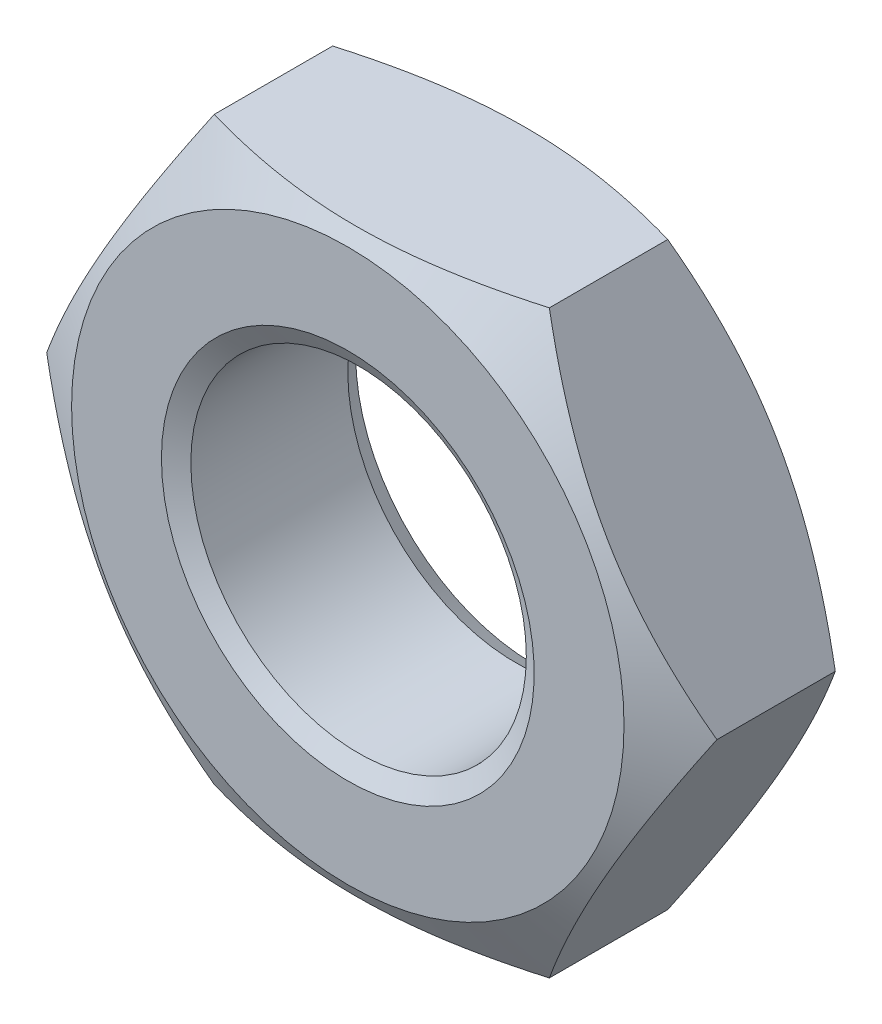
from build123d import *
from OCP.BRepFilletAPI import BRepFilletAPI_MakeChamfer

# Parameters (mm, degrees)
SKETCH1_R        = 4.5
BASENUT_DEPTH    = 5
ENDCHAMFER_SIZE  = 0.5
ENDCHAMFER_SIZE2 = 0.288675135


with BuildPart() as part:
    # Sketch1 → BaseNut (new body)
    with BuildSketch(Plane.XY):
        Polygon((4.494671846, -7.785), (8.989343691, 0), (4.494671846, 7.785), (-4.494671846, 7.785), (-8.989343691, 0), (-4.494671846, -7.785), align=None)
        Circle(SKETCH1_R, mode=Mode.SUBTRACT)
    extrude(amount=-BASENUT_DEPTH)

    # Sketch2 → Double-Chamfer (revolve, cut)
    with BuildSketch(Plane(origin=(0, 0, 0), x_dir=(1, 0, 0), z_dir=(0, 1, 0))):
        Polygon((-8.989343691, 5), (-7.41, 5), (-8.989343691, 4.088165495), align=None)
        Polygon((-8.989343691, 0.911834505), (-8.989343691, 0), (-7.41, 0), align=None)
    revolve(axis=Axis((0, 0, -3.375940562), (0, 0, 1)), mode=Mode.SUBTRACT)

    # EndChamfer: one chamfer whose edges measure the first distance from different faces: ONE call of the kernel's chamfer builder (chamfer() names one face for all edges)
    endchamfer_edges_1 = [part.edges().sort_by_distance(p)[0] for p in [
        (-4.5, 0, -5),
    ]]
    endchamfer_side_1 = [part.faces().sort_by_distance(p)[0] for p in [
        (-4.5, 0, -2.5),
    ]]
    endchamfer_edges_2 = [part.edges().sort_by_distance(p)[0] for p in [
        (-4.5, 0, 0),
    ]]
    endchamfer_side_2 = [part.faces().sort_by_distance(p)[0] for p in [
        (7.20041355, 0, 0),
    ]]
    endchamfer = BRepFilletAPI_MakeChamfer(part.part.solid().wrapped)
    for e in endchamfer_edges_1:
        endchamfer.Add(ENDCHAMFER_SIZE, ENDCHAMFER_SIZE2, e.wrapped, endchamfer_side_1[0].wrapped)  # the first distance lies on this face
    for e in endchamfer_edges_2:
        endchamfer.Add(ENDCHAMFER_SIZE, ENDCHAMFER_SIZE2, e.wrapped, endchamfer_side_2[0].wrapped)  # the first distance lies on this face
    add(Compound.cast(endchamfer.Shape()), mode=Mode.REPLACE)


solid = part.part
